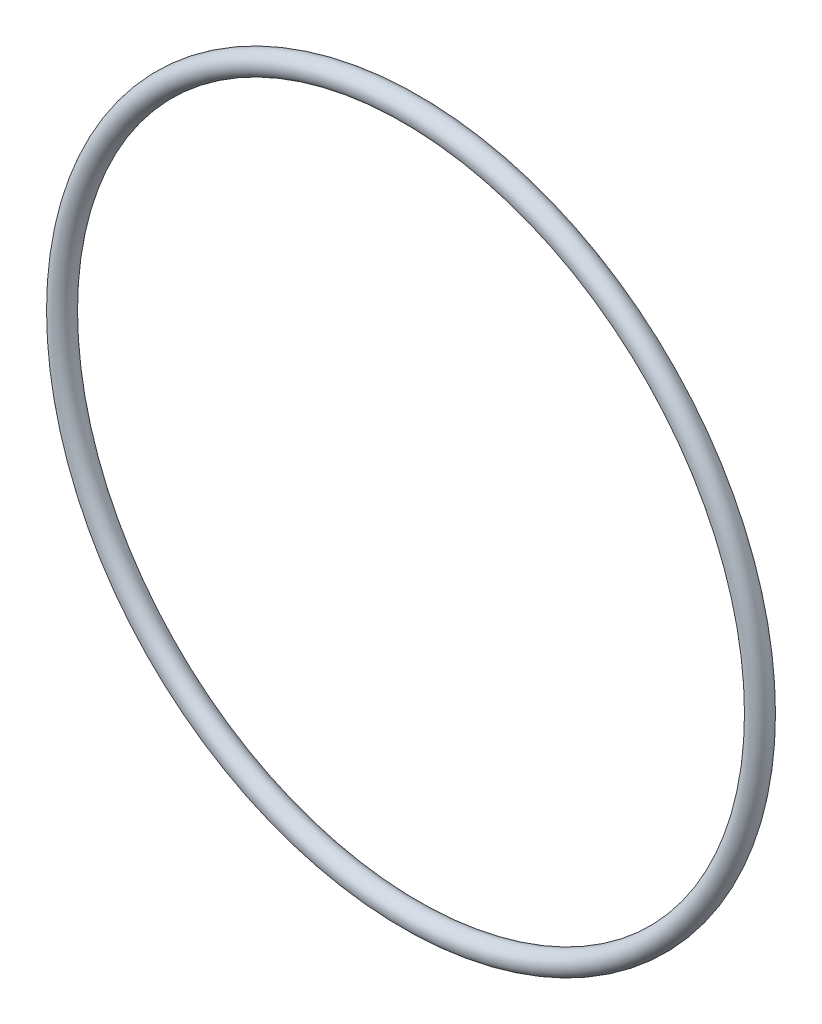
from build123d import *

# Parameters (mm, degrees)
SKETCH1_R = 3.4925


with BuildPart() as part:
    # Sketch1 → Revolve1 (revolve)
    with BuildSketch(Plane(origin=(0, 0, 0), x_dir=(0, -1, 0), z_dir=(1, 0, 0)), mode=Mode.PRIVATE) as revolve1_sk:
        with Locations((111.125, 0)):
            Circle(SKETCH1_R)
    revolve(revolve1_sk.sketch.rotate(Axis((0, 0, 3.4925), (0, 0, -1)), 270), axis=Axis((0, 0, 3.4925), (0, 0, -1)))


solid = part.part
